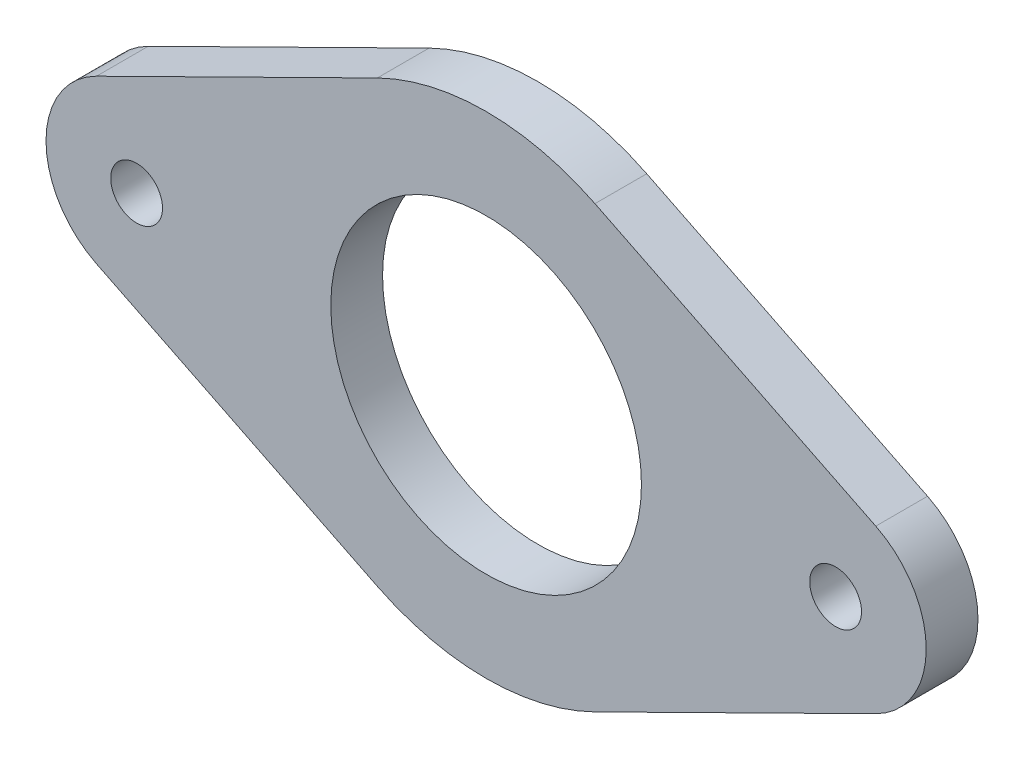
ISO-10303-21;
HEADER;
FILE_DESCRIPTION(('STEP AP214'),'2;1');
FILE_NAME('part.step','',(''),(''),'','','');
FILE_SCHEMA(('AUTOMOTIVE_DESIGN { 1 0 10303 214 1 1 1 1 }'));
ENDSEC;
DATA;
#1=APPLICATION_CONTEXT('core data for automotive mechanical design processes');
#2=APPLICATION_PROTOCOL_DEFINITION('international standard','automotive_design',2000,#1);
#3=PRODUCT_CONTEXT('',#1,'mechanical');
#4=PRODUCT('Part','Part','',(#3));
#5=PRODUCT_RELATED_PRODUCT_CATEGORY('part','',(#4));
#6=PRODUCT_DEFINITION_FORMATION('','',#4);
#7=PRODUCT_DEFINITION_CONTEXT('part definition',#1,'design');
#8=PRODUCT_DEFINITION('design','',#6,#7);
#9=PRODUCT_DEFINITION_SHAPE('','',#8);
#10=(LENGTH_UNIT() NAMED_UNIT(*) SI_UNIT(.MILLI.,.METRE.));
#11=(NAMED_UNIT(*) PLANE_ANGLE_UNIT() SI_UNIT($,.RADIAN.));
#12=(NAMED_UNIT(*) SI_UNIT($,.STERADIAN.) SOLID_ANGLE_UNIT());
#13=UNCERTAINTY_MEASURE_WITH_UNIT(LENGTH_MEASURE(1.E-05),#10,'distance_accuracy_value','');
#14=(GEOMETRIC_REPRESENTATION_CONTEXT(3) GLOBAL_UNCERTAINTY_ASSIGNED_CONTEXT((#13)) GLOBAL_UNIT_ASSIGNED_CONTEXT((#10,
#11,#12)) REPRESENTATION_CONTEXT('',''));
#15=CARTESIAN_POINT('',(0.,0.,0.));
#16=DIRECTION('',(0.,0.,1.));
#17=DIRECTION('',(1.,0.,0.));
#18=AXIS2_PLACEMENT_3D('',#15,#16,#17);
#19=CARTESIAN_POINT('',(27.,0.,3.99999999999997));
#20=DIRECTION('',(0.,0.,-1.));
#21=DIRECTION('',(-1.,0.,0.));
#22=AXIS2_PLACEMENT_3D('',#19,#20,#21);
#23=PLANE('',#22);
#24=CARTESIAN_POINT('',(-27.,0.,4.00000000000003));
#25=DIRECTION('',(0.,0.,1.));
#26=DIRECTION('',(1.,0.,0.));
#27=AXIS2_PLACEMENT_3D('',#24,#25,#26);
#28=CIRCLE('',#27,2.);
#29=CARTESIAN_POINT('',(-25.,0.,4.00000000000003));
#30=VERTEX_POINT('',#29);
#31=EDGE_CURVE('E228',#30,#30,#28,.T.);
#32=ORIENTED_EDGE('',*,*,#31,.F.);
#33=EDGE_LOOP('',(#32));
#34=FACE_BOUND('',#33,.T.);
#35=CARTESIAN_POINT('',(27.,0.,3.99999999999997));
#36=DIRECTION('',(0.,0.,1.));
#37=DIRECTION('',(-1.,0.,0.));
#38=AXIS2_PLACEMENT_3D('',#35,#36,#37);
#39=CIRCLE('',#38,7.);
#40=CARTESIAN_POINT('',(30.102764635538,-6.27477900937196,3.99999999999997));
#41=VERTEX_POINT('',#40);
#42=CARTESIAN_POINT('',(30.102764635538,6.27477900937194,3.99999999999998));
#43=VERTEX_POINT('',#42);
#44=EDGE_CURVE('E133',#41,#43,#39,.T.);
#45=ORIENTED_EDGE('',*,*,#44,.T.);
#46=DIRECTION('',(-0.89639700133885,0.44325209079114,0.));
#47=VECTOR('',#46,1.);
#48=CARTESIAN_POINT('',(30.102764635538,6.27477900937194,3.99999999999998));
#49=LINE('',#48,#47);
#50=CARTESIAN_POINT('',(8.40751986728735,17.0026848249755,4.00000000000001));
#51=VERTEX_POINT('',#50);
#52=EDGE_CURVE('E110',#43,#51,#49,.T.);
#53=ORIENTED_EDGE('',*,*,#52,.T.);
#54=CARTESIAN_POINT('',(0.,0.,4.));
#55=DIRECTION('',(0.,0.,1.));
#56=DIRECTION('',(1.,0.,0.));
#57=AXIS2_PLACEMENT_3D('',#54,#55,#56);
#58=CIRCLE('',#57,18.9678064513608);
#59=CARTESIAN_POINT('',(-8.40751986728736,17.0026848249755,4.00000000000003));
#60=VERTEX_POINT('',#59);
#61=EDGE_CURVE('E136',#51,#60,#58,.T.);
#62=ORIENTED_EDGE('',*,*,#61,.T.);
#63=DIRECTION('',(-0.89639700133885,-0.44325209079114,0.));
#64=VECTOR('',#63,1.);
#65=CARTESIAN_POINT('',(-30.102764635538,6.27477900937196,4.00000000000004));
#66=LINE('',#65,#64);
#67=CARTESIAN_POINT('',(-30.102764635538,6.27477900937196,4.00000000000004));
#68=VERTEX_POINT('',#67);
#69=EDGE_CURVE('E138',#60,#68,#66,.T.);
#70=ORIENTED_EDGE('',*,*,#69,.T.);
#71=CARTESIAN_POINT('',(-27.,0.,4.00000000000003));
#72=DIRECTION('',(0.,0.,1.));
#73=DIRECTION('',(1.,0.,0.));
#74=AXIS2_PLACEMENT_3D('',#71,#72,#73);
#75=CIRCLE('',#74,7.);
#76=CARTESIAN_POINT('',(-30.102764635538,-6.27477900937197,4.00000000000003));
#77=VERTEX_POINT('',#76);
#78=EDGE_CURVE('E140',#68,#77,#75,.T.);
#79=ORIENTED_EDGE('',*,*,#78,.T.);
#80=DIRECTION('',(0.89639700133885,-0.44325209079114,0.));
#81=VECTOR('',#80,1.);
#82=CARTESIAN_POINT('',(-30.102764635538,-6.27477900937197,4.00000000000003));
#83=LINE('',#82,#81);
#84=CARTESIAN_POINT('',(-8.40751986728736,-17.0026848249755,4.));
#85=VERTEX_POINT('',#84);
#86=EDGE_CURVE('E142',#77,#85,#83,.T.);
#87=ORIENTED_EDGE('',*,*,#86,.T.);
#88=CARTESIAN_POINT('',(0.,0.,4.));
#89=DIRECTION('',(0.,0.,1.));
#90=DIRECTION('',(1.,0.,0.));
#91=AXIS2_PLACEMENT_3D('',#88,#89,#90);
#92=CIRCLE('',#91,18.9678064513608);
#93=CARTESIAN_POINT('',(8.40751986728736,-17.0026848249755,3.99999999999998));
#94=VERTEX_POINT('',#93);
#95=EDGE_CURVE('E51',#85,#94,#92,.T.);
#96=ORIENTED_EDGE('',*,*,#95,.T.);
#97=DIRECTION('',(0.89639700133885,0.44325209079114,0.));
#98=VECTOR('',#97,1.);
#99=CARTESIAN_POINT('',(30.102764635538,-6.27477900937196,3.99999999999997));
#100=LINE('',#99,#98);
#101=EDGE_CURVE('E46',#94,#41,#100,.T.);
#102=ORIENTED_EDGE('',*,*,#101,.T.);
#103=EDGE_LOOP('',(#45,#53,#62,#70,#79,#87,#96,#102));
#104=FACE_BOUND('',#103,.T.);
#105=CARTESIAN_POINT('',(0.,0.,4.));
#106=DIRECTION('',(0.,0.,1.));
#107=DIRECTION('',(1.,0.,0.));
#108=AXIS2_PLACEMENT_3D('',#105,#106,#107);
#109=CIRCLE('',#108,12.);
#110=CARTESIAN_POINT('',(12.,0.,3.99999999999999));
#111=VERTEX_POINT('',#110);
#112=EDGE_CURVE('E115',#111,#111,#109,.T.);
#113=ORIENTED_EDGE('',*,*,#112,.F.);
#114=EDGE_LOOP('',(#113));
#115=FACE_BOUND('',#114,.T.);
#116=CARTESIAN_POINT('',(27.,0.,3.99999999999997));
#117=DIRECTION('',(0.,0.,1.));
#118=DIRECTION('',(1.,0.,0.));
#119=AXIS2_PLACEMENT_3D('',#116,#117,#118);
#120=CIRCLE('',#119,2.);
#121=CARTESIAN_POINT('',(29.,0.,3.99999999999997));
#122=VERTEX_POINT('',#121);
#123=EDGE_CURVE('E217',#122,#122,#120,.T.);
#124=ORIENTED_EDGE('',*,*,#123,.F.);
#125=EDGE_LOOP('',(#124));
#126=FACE_BOUND('',#125,.T.);
#127=ADVANCED_FACE('F31',(#34,#104,#115,#126),#23,.F.);
#128=CARTESIAN_POINT('',(27.,0.,0.));
#129=DIRECTION('',(0.,0.,-1.));
#130=DIRECTION('',(-1.,0.,0.));
#131=AXIS2_PLACEMENT_3D('',#128,#129,#130);
#132=PLANE('',#131);
#133=CARTESIAN_POINT('',(-27.,0.,0.));
#134=DIRECTION('',(0.,0.,1.));
#135=DIRECTION('',(1.,0.,0.));
#136=AXIS2_PLACEMENT_3D('',#133,#134,#135);
#137=CIRCLE('',#136,2.);
#138=CARTESIAN_POINT('',(-25.,0.,0.));
#139=VERTEX_POINT('',#138);
#140=EDGE_CURVE('E223',#139,#139,#137,.T.);
#141=ORIENTED_EDGE('',*,*,#140,.T.);
#142=EDGE_LOOP('',(#141));
#143=FACE_BOUND('',#142,.T.);
#144=CARTESIAN_POINT('',(27.,0.,0.));
#145=DIRECTION('',(0.,0.,1.));
#146=DIRECTION('',(-1.,0.,0.));
#147=AXIS2_PLACEMENT_3D('',#144,#145,#146);
#148=CIRCLE('',#147,7.);
#149=CARTESIAN_POINT('',(30.102764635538,-6.27477900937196,0.));
#150=VERTEX_POINT('',#149);
#151=CARTESIAN_POINT('',(30.102764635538,6.27477900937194,0.));
#152=VERTEX_POINT('',#151);
#153=EDGE_CURVE('E101',#150,#152,#148,.T.);
#154=ORIENTED_EDGE('',*,*,#153,.F.);
#155=DIRECTION('',(0.89639700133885,0.44325209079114,0.));
#156=VECTOR('',#155,1.);
#157=CARTESIAN_POINT('',(30.102764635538,-6.27477900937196,0.));
#158=LINE('',#157,#156);
#159=CARTESIAN_POINT('',(8.40751986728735,-17.0026848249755,0.));
#160=VERTEX_POINT('',#159);
#161=EDGE_CURVE('E131',#160,#150,#158,.T.);
#162=ORIENTED_EDGE('',*,*,#161,.F.);
#163=CARTESIAN_POINT('',(0.,0.,0.));
#164=DIRECTION('',(0.,0.,1.));
#165=DIRECTION('',(1.,0.,0.));
#166=AXIS2_PLACEMENT_3D('',#163,#164,#165);
#167=CIRCLE('',#166,18.9678064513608);
#168=CARTESIAN_POINT('',(-8.40751986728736,-17.0026848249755,0.));
#169=VERTEX_POINT('',#168);
#170=EDGE_CURVE('E129',#169,#160,#167,.T.);
#171=ORIENTED_EDGE('',*,*,#170,.F.);
#172=DIRECTION('',(0.89639700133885,-0.44325209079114,0.));
#173=VECTOR('',#172,1.);
#174=CARTESIAN_POINT('',(-30.102764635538,-6.27477900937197,0.));
#175=LINE('',#174,#173);
#176=CARTESIAN_POINT('',(-30.102764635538,-6.27477900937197,0.));
#177=VERTEX_POINT('',#176);
#178=EDGE_CURVE('E127',#177,#169,#175,.T.);
#179=ORIENTED_EDGE('',*,*,#178,.F.);
#180=CARTESIAN_POINT('',(-27.,0.,0.));
#181=DIRECTION('',(0.,0.,1.));
#182=DIRECTION('',(1.,0.,0.));
#183=AXIS2_PLACEMENT_3D('',#180,#181,#182);
#184=CIRCLE('',#183,7.);
#185=CARTESIAN_POINT('',(-30.102764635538,6.27477900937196,0.));
#186=VERTEX_POINT('',#185);
#187=EDGE_CURVE('E125',#186,#177,#184,.T.);
#188=ORIENTED_EDGE('',*,*,#187,.F.);
#189=DIRECTION('',(-0.89639700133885,-0.44325209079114,0.));
#190=VECTOR('',#189,1.);
#191=CARTESIAN_POINT('',(-30.102764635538,6.27477900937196,0.));
#192=LINE('',#191,#190);
#193=CARTESIAN_POINT('',(-8.40751986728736,17.0026848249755,0.));
#194=VERTEX_POINT('',#193);
#195=EDGE_CURVE('E123',#194,#186,#192,.T.);
#196=ORIENTED_EDGE('',*,*,#195,.F.);
#197=CARTESIAN_POINT('',(0.,0.,0.));
#198=DIRECTION('',(0.,0.,1.));
#199=DIRECTION('',(1.,0.,0.));
#200=AXIS2_PLACEMENT_3D('',#197,#198,#199);
#201=CIRCLE('',#200,18.9678064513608);
#202=CARTESIAN_POINT('',(8.40751986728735,17.0026848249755,0.));
#203=VERTEX_POINT('',#202);
#204=EDGE_CURVE('E103',#203,#194,#201,.T.);
#205=ORIENTED_EDGE('',*,*,#204,.F.);
#206=DIRECTION('',(-0.89639700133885,0.44325209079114,0.));
#207=VECTOR('',#206,1.);
#208=CARTESIAN_POINT('',(30.102764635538,6.27477900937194,0.));
#209=LINE('',#208,#207);
#210=EDGE_CURVE('E96',#152,#203,#209,.T.);
#211=ORIENTED_EDGE('',*,*,#210,.F.);
#212=EDGE_LOOP('',(#154,#162,#171,#179,#188,#196,#205,#211));
#213=FACE_BOUND('',#212,.T.);
#214=CARTESIAN_POINT('',(0.,0.,0.));
#215=DIRECTION('',(0.,0.,1.));
#216=DIRECTION('',(1.,0.,0.));
#217=AXIS2_PLACEMENT_3D('',#214,#215,#216);
#218=CIRCLE('',#217,12.);
#219=CARTESIAN_POINT('',(12.,0.,0.));
#220=VERTEX_POINT('',#219);
#221=EDGE_CURVE('E118',#220,#220,#218,.T.);
#222=ORIENTED_EDGE('',*,*,#221,.T.);
#223=EDGE_LOOP('',(#222));
#224=FACE_BOUND('',#223,.T.);
#225=CARTESIAN_POINT('',(27.,0.,0.));
#226=DIRECTION('',(0.,0.,1.));
#227=DIRECTION('',(1.,0.,0.));
#228=AXIS2_PLACEMENT_3D('',#225,#226,#227);
#229=CIRCLE('',#228,2.);
#230=CARTESIAN_POINT('',(29.,0.,0.));
#231=VERTEX_POINT('',#230);
#232=EDGE_CURVE('E220',#231,#231,#229,.T.);
#233=ORIENTED_EDGE('',*,*,#232,.T.);
#234=EDGE_LOOP('',(#233));
#235=FACE_BOUND('',#234,.T.);
#236=ADVANCED_FACE('F97',(#143,#213,#224,#235),#132,.T.);
#237=CARTESIAN_POINT('',(27.,0.,3.99999999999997));
#238=DIRECTION('',(0.,0.,-1.));
#239=DIRECTION('',(-1.,0.,0.));
#240=AXIS2_PLACEMENT_3D('',#237,#238,#239);
#241=CYLINDRICAL_SURFACE('',#240,7.);
#242=ORIENTED_EDGE('',*,*,#153,.T.);
#243=DIRECTION('',(0.,0.,-1.));
#244=VECTOR('',#243,1.);
#245=CARTESIAN_POINT('',(30.102764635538,6.27477900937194,3.99999999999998));
#246=LINE('',#245,#244);
#247=EDGE_CURVE('E11',#43,#152,#246,.T.);
#248=ORIENTED_EDGE('',*,*,#247,.F.);
#249=ORIENTED_EDGE('',*,*,#44,.F.);
#250=DIRECTION('',(0.,0.,-1.));
#251=VECTOR('',#250,1.);
#252=CARTESIAN_POINT('',(30.102764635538,-6.27477900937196,3.99999999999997));
#253=LINE('',#252,#251);
#254=EDGE_CURVE('E114',#41,#150,#253,.T.);
#255=ORIENTED_EDGE('',*,*,#254,.T.);
#256=EDGE_LOOP('',(#242,#248,#249,#255));
#257=FACE_BOUND('',#256,.T.);
#258=ADVANCED_FACE('F33',(#257),#241,.T.);
#259=CARTESIAN_POINT('',(30.102764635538,6.27477900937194,3.99999999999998));
#260=DIRECTION('',(-0.44325209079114,-0.89639700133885,0.));
#261=DIRECTION('',(0.89639700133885,-0.44325209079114,0.));
#262=AXIS2_PLACEMENT_3D('',#259,#260,#261);
#263=PLANE('',#262);
#264=ORIENTED_EDGE('',*,*,#210,.T.);
#265=DIRECTION('',(0.,0.,-1.));
#266=VECTOR('',#265,1.);
#267=CARTESIAN_POINT('',(8.40751986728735,17.0026848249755,4.00000000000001));
#268=LINE('',#267,#266);
#269=EDGE_CURVE('E39',#51,#203,#268,.T.);
#270=ORIENTED_EDGE('',*,*,#269,.F.);
#271=ORIENTED_EDGE('',*,*,#52,.F.);
#272=ORIENTED_EDGE('',*,*,#247,.T.);
#273=EDGE_LOOP('',(#264,#270,#271,#272));
#274=FACE_BOUND('',#273,.T.);
#275=ADVANCED_FACE('F109',(#274),#263,.F.);
#276=CARTESIAN_POINT('',(0.,0.,4.));
#277=DIRECTION('',(0.,0.,-1.));
#278=DIRECTION('',(-1.,0.,0.));
#279=AXIS2_PLACEMENT_3D('',#276,#277,#278);
#280=CYLINDRICAL_SURFACE('',#279,18.9678064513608);
#281=ORIENTED_EDGE('',*,*,#204,.T.);
#282=DIRECTION('',(0.,0.,-1.));
#283=VECTOR('',#282,1.);
#284=CARTESIAN_POINT('',(-8.40751986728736,17.0026848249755,4.00000000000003));
#285=LINE('',#284,#283);
#286=EDGE_CURVE('E159',#60,#194,#285,.T.);
#287=ORIENTED_EDGE('',*,*,#286,.F.);
#288=ORIENTED_EDGE('',*,*,#61,.F.);
#289=ORIENTED_EDGE('',*,*,#269,.T.);
#290=EDGE_LOOP('',(#281,#287,#288,#289));
#291=FACE_BOUND('',#290,.T.);
#292=ADVANCED_FACE('F163',(#291),#280,.T.);
#293=CARTESIAN_POINT('',(-30.102764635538,6.27477900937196,4.00000000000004));
#294=DIRECTION('',(0.44325209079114,-0.89639700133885,0.));
#295=DIRECTION('',(0.89639700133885,0.44325209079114,0.));
#296=AXIS2_PLACEMENT_3D('',#293,#294,#295);
#297=PLANE('',#296);
#298=ORIENTED_EDGE('',*,*,#195,.T.);
#299=DIRECTION('',(0.,0.,-1.));
#300=VECTOR('',#299,1.);
#301=CARTESIAN_POINT('',(-30.102764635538,6.27477900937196,4.00000000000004));
#302=LINE('',#301,#300);
#303=EDGE_CURVE('E156',#68,#186,#302,.T.);
#304=ORIENTED_EDGE('',*,*,#303,.F.);
#305=ORIENTED_EDGE('',*,*,#69,.F.);
#306=ORIENTED_EDGE('',*,*,#286,.T.);
#307=EDGE_LOOP('',(#298,#304,#305,#306));
#308=FACE_BOUND('',#307,.T.);
#309=ADVANCED_FACE('F171',(#308),#297,.F.);
#310=CARTESIAN_POINT('',(-27.,0.,4.00000000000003));
#311=DIRECTION('',(0.,0.,-1.));
#312=DIRECTION('',(-1.,0.,0.));
#313=AXIS2_PLACEMENT_3D('',#310,#311,#312);
#314=CYLINDRICAL_SURFACE('',#313,7.);
#315=ORIENTED_EDGE('',*,*,#187,.T.);
#316=DIRECTION('',(0.,0.,-1.));
#317=VECTOR('',#316,1.);
#318=CARTESIAN_POINT('',(-30.102764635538,-6.27477900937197,4.00000000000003));
#319=LINE('',#318,#317);
#320=EDGE_CURVE('E153',#77,#177,#319,.T.);
#321=ORIENTED_EDGE('',*,*,#320,.F.);
#322=ORIENTED_EDGE('',*,*,#78,.F.);
#323=ORIENTED_EDGE('',*,*,#303,.T.);
#324=EDGE_LOOP('',(#315,#321,#322,#323));
#325=FACE_BOUND('',#324,.T.);
#326=ADVANCED_FACE('F174',(#325),#314,.T.);
#327=CARTESIAN_POINT('',(-30.102764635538,-6.27477900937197,4.00000000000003));
#328=DIRECTION('',(0.44325209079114,0.89639700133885,0.));
#329=DIRECTION('',(-0.89639700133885,0.44325209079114,0.));
#330=AXIS2_PLACEMENT_3D('',#327,#328,#329);
#331=PLANE('',#330);
#332=ORIENTED_EDGE('',*,*,#178,.T.);
#333=DIRECTION('',(0.,0.,-1.));
#334=VECTOR('',#333,1.);
#335=CARTESIAN_POINT('',(-8.40751986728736,-17.0026848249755,4.));
#336=LINE('',#335,#334);
#337=EDGE_CURVE('E150',#85,#169,#336,.T.);
#338=ORIENTED_EDGE('',*,*,#337,.F.);
#339=ORIENTED_EDGE('',*,*,#86,.F.);
#340=ORIENTED_EDGE('',*,*,#320,.T.);
#341=EDGE_LOOP('',(#332,#338,#339,#340));
#342=FACE_BOUND('',#341,.T.);
#343=ADVANCED_FACE('F179',(#342),#331,.F.);
#344=CARTESIAN_POINT('',(0.,0.,4.));
#345=DIRECTION('',(0.,0.,-1.));
#346=DIRECTION('',(-1.,0.,0.));
#347=AXIS2_PLACEMENT_3D('',#344,#345,#346);
#348=CYLINDRICAL_SURFACE('',#347,18.9678064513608);
#349=ORIENTED_EDGE('',*,*,#170,.T.);
#350=DIRECTION('',(0.,0.,-1.));
#351=VECTOR('',#350,1.);
#352=CARTESIAN_POINT('',(8.40751986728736,-17.0026848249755,3.99999999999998));
#353=LINE('',#352,#351);
#354=EDGE_CURVE('E147',#94,#160,#353,.T.);
#355=ORIENTED_EDGE('',*,*,#354,.F.);
#356=ORIENTED_EDGE('',*,*,#95,.F.);
#357=ORIENTED_EDGE('',*,*,#337,.T.);
#358=EDGE_LOOP('',(#349,#355,#356,#357));
#359=FACE_BOUND('',#358,.T.);
#360=ADVANCED_FACE('F182',(#359),#348,.T.);
#361=CARTESIAN_POINT('',(30.102764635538,-6.27477900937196,3.99999999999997));
#362=DIRECTION('',(-0.44325209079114,0.89639700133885,0.));
#363=DIRECTION('',(-0.89639700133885,-0.44325209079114,0.));
#364=AXIS2_PLACEMENT_3D('',#361,#362,#363);
#365=PLANE('',#364);
#366=ORIENTED_EDGE('',*,*,#161,.T.);
#367=ORIENTED_EDGE('',*,*,#254,.F.);
#368=ORIENTED_EDGE('',*,*,#101,.F.);
#369=ORIENTED_EDGE('',*,*,#354,.T.);
#370=EDGE_LOOP('',(#366,#367,#368,#369));
#371=FACE_BOUND('',#370,.T.);
#372=ADVANCED_FACE('F184',(#371),#365,.F.);
#373=CARTESIAN_POINT('',(0.,0.,4.));
#374=DIRECTION('',(0.,0.,-1.));
#375=DIRECTION('',(-1.,0.,0.));
#376=AXIS2_PLACEMENT_3D('',#373,#374,#375);
#377=CYLINDRICAL_SURFACE('',#376,12.);
#378=ORIENTED_EDGE('',*,*,#112,.T.);
#379=EDGE_LOOP('',(#378));
#380=FACE_BOUND('',#379,.T.);
#381=ORIENTED_EDGE('',*,*,#221,.F.);
#382=EDGE_LOOP('',(#381));
#383=FACE_BOUND('',#382,.T.);
#384=ADVANCED_FACE('F186',(#380,#383),#377,.F.);
#385=CARTESIAN_POINT('',(-27.,0.,4.00000000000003));
#386=DIRECTION('',(0.,0.,-1.));
#387=DIRECTION('',(-1.,0.,0.));
#388=AXIS2_PLACEMENT_3D('',#385,#386,#387);
#389=CYLINDRICAL_SURFACE('',#388,2.);
#390=ORIENTED_EDGE('',*,*,#31,.T.);
#391=EDGE_LOOP('',(#390));
#392=FACE_BOUND('',#391,.T.);
#393=ORIENTED_EDGE('',*,*,#140,.F.);
#394=EDGE_LOOP('',(#393));
#395=FACE_BOUND('',#394,.T.);
#396=ADVANCED_FACE('F192',(#392,#395),#389,.F.);
#397=CARTESIAN_POINT('',(27.,0.,3.99999999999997));
#398=DIRECTION('',(0.,0.,-1.));
#399=DIRECTION('',(-1.,0.,0.));
#400=AXIS2_PLACEMENT_3D('',#397,#398,#399);
#401=CYLINDRICAL_SURFACE('',#400,2.);
#402=ORIENTED_EDGE('',*,*,#123,.T.);
#403=EDGE_LOOP('',(#402));
#404=FACE_BOUND('',#403,.T.);
#405=ORIENTED_EDGE('',*,*,#232,.F.);
#406=EDGE_LOOP('',(#405));
#407=FACE_BOUND('',#406,.T.);
#408=ADVANCED_FACE('F208',(#404,#407),#401,.F.);
#409=CLOSED_SHELL('',(#127,#236,#258,#275,#292,#309,#326,#343,#360,#372,#384,#396,#408));
#410=MANIFOLD_SOLID_BREP('B2',#409);
#411=ADVANCED_BREP_SHAPE_REPRESENTATION('',(#18,#410),#14);
#412=SHAPE_DEFINITION_REPRESENTATION(#9,#411);
ENDSEC;
END-ISO-10303-21;
